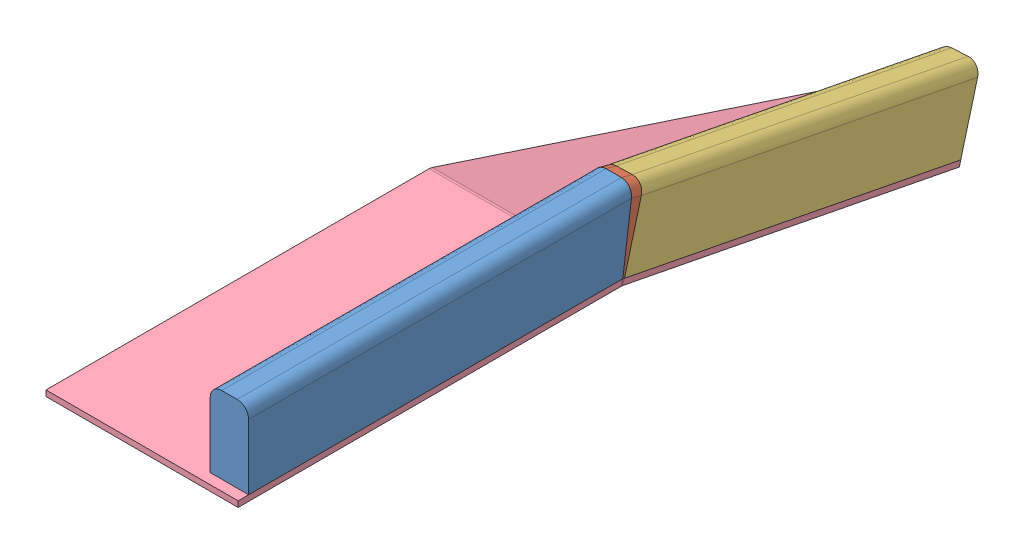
SolidWorks assembly Gehrung 2.SLDASM, configuration Standard (file format 3400). Lengths in mm.
Overall size (50.01 47.36 201.92).
4 component instances, 4 part files, 9 mates.
Components (placement in the parent):
- Leiste-1: Leiste.SLDPRT [Standard] at (-36.9096 0.2294 -50) size (10 20 100)
- Leiste_keil-1: Leiste_keil.SLDPRT [Standard] at (-26.9096 0.9109 -44.8236) x (-1 0 0) z (0 -0.258819 -0.965926) size (10 20 3.07)
- Leiste_oben-1: Leiste_oben.SLDPRT [Standard] at (-26.9096 0.1164 -47.7887) x (-0.996195 0.022558 0.084186) z (-0.087156 -0.257834 -0.96225) size (10 20 100)
- Blech-1: Blech.SLDPRT [Standard] at (-26.9096 0.2294 52.7335) x (-1 0 0) z (0 -1 0) size (50.01 196.79 27.36)
Mates (geometry in assembly coordinates):
- Deckungsgleich1: coincident anti-aligned: plane of Leiste-1 through (-36.9096 20.2294 -50) normal (0 -0.130526 -0.991445); plane of Leiste_keil-1 through (-36.9096 20.2294 -50) normal (0 0.130526 0.991445)
- Deckungsgleich2: coincident anti-aligned: line of Leiste-1; line of Leiste_keil-1
- Deckungsgleich3: coincident aligned: line of Leiste-1; line of Leiste_keil-1
- Deckungsgleich7: coincident anti-aligned: plane of ?; plane of ?
- Deckungsgleich8: coincident anti-aligned: line of ?; line of ?
- Deckungsgleich9: coincident aligned: line of ?; line of ?
- Deckungsgleich10: coincident anti-aligned: plane of ?; plane of ?
- Deckungsgleich11: coincident anti-aligned: plane of ?; plane of ?
- Deckungsgleich12: coincident aligned: plane of ?; plane of ?
